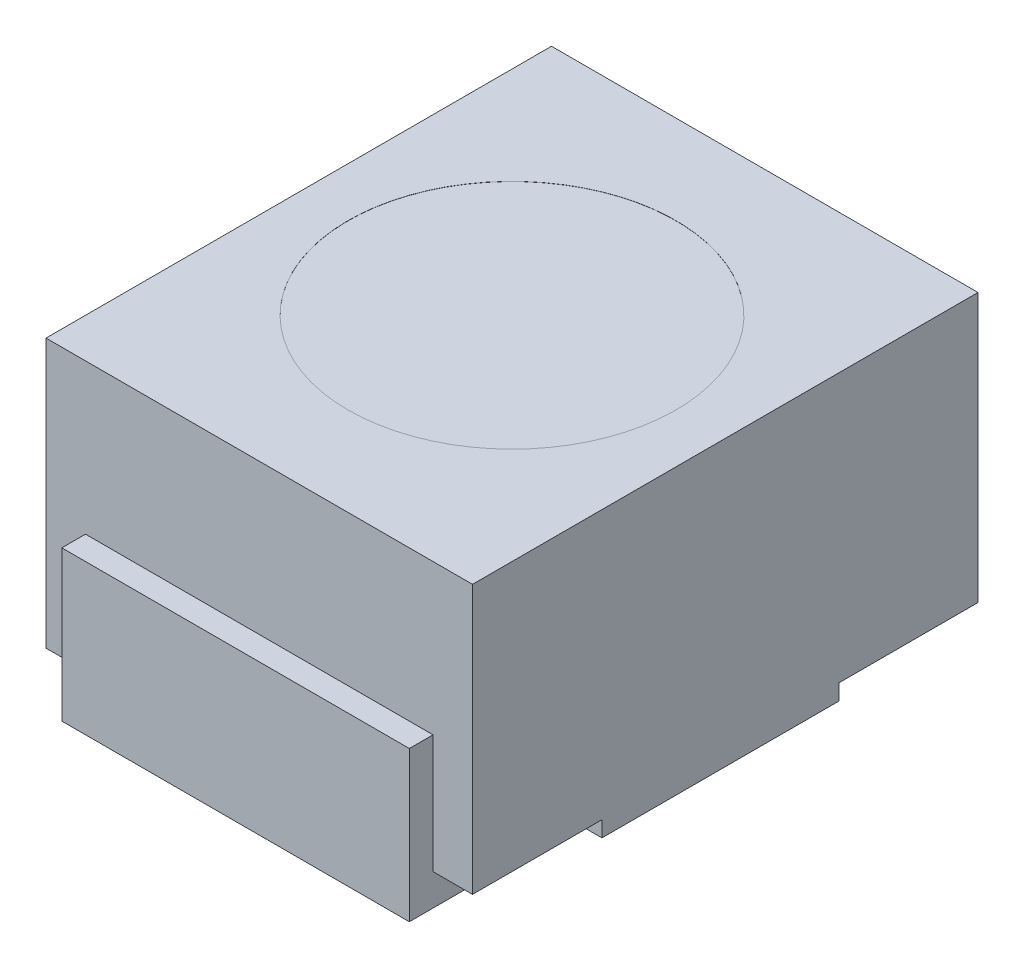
from build123d import *

# Parameters (mm, degrees)
SKETCH1_W           = 2.7
SKETCH1_H           = 3.2
BOSS_EXTRUDE1_DEPTH = 1.9
SKETCH4_W           = 2.2
SKETCH4_H           = 0.15
BOSS_EXTRUDE3_DEPTH = 0.95
SKETCH5_W           = 2.7
SKETCH5_H           = 2.828374
CUT_EXTRUDE1_DEPTH  = 0.2
SKETCH6_W           = 2.7
SKETCH6_H           = 1.5
BOSS_EXTRUDE4_DEPTH = 0.1
SKETCH7_W           = 0.332449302
SKETCH7_H           = 0.293104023
SKETCH7_W_2         = 0.537900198
SKETCH7_H_2         = 0.361587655
SKETCH7_W_3         = 0.25
SKETCH7_H_3         = 0.390122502
SKETCH7_W_4         = 0.463709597
CUT_EXTRUDE3_DEPTH  = 3.788368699
SKETCH8_W           = 2.2
SKETCH8_H           = 0.455429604
SKETCH8_H_2         = 0.575274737
BOSS_EXTRUDE5_DEPTH = 0.2
SKETCH9_R           = 1.038229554
CUT_EXTRUDE4_DEPTH  = 0.001


with BuildPart() as part:
    # Sketch1 → Boss-Extrude1 (new body)
    with BuildSketch(Plane(origin=(0, 0, 0), x_dir=(1, 0, 0), z_dir=(0, 1, 0))):
        Rectangle(SKETCH1_W, SKETCH1_H)
    extrude(amount=BOSS_EXTRUDE1_DEPTH)

    # Sketch4 → Boss-Extrude3 (add)
    with BuildSketch(Plane.XZ):
        with Locations((0, 1.675)):
            Rectangle(SKETCH4_W, SKETCH4_H)
        with Locations((0, -1.675)):
            Rectangle(SKETCH4_W, SKETCH4_H)
    extrude(amount=-BOSS_EXTRUDE3_DEPTH)

    # Sketch5 → Cut-Extrude1 (cut)
    with BuildSketch(Plane.XZ):
        with Locations((0, -0.017120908)):
            Rectangle(SKETCH5_W, SKETCH5_H)
    extrude(amount=-CUT_EXTRUDE1_DEPTH, mode=Mode.SUBTRACT)

    # Sketch6 → Boss-Extrude4 (add)
    with BuildSketch(Plane.XZ.offset(-0.2)):
        with Locations((0, 0.030713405)):
            Rectangle(SKETCH6_W, SKETCH6_H)
    extrude(amount=BOSS_EXTRUDE4_DEPTH)

    # Sketch7 → Cut-Extrude3 (cut, through all)
    with BuildSketch(Plane.XZ.offset(-0.2)):
        with Locations((-1.266224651, 1.453447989)):
            Rectangle(SKETCH7_W, SKETCH7_H)
        with Locations((1.368950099, 1.419206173)):
            Rectangle(SKETCH7_W_2, SKETCH7_H_2)
        with Locations((-1.225, -1.404938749)):
            Rectangle(SKETCH7_W_3, SKETCH7_H_3)
        with Locations((1.331854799, -1.404938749)):
            Rectangle(SKETCH7_W_4, SKETCH7_H_3)
    extrude(amount=CUT_EXTRUDE3_DEPTH, mode=Mode.SUBTRACT)

    # Sketch8 → Boss-Extrude5 (add)
    with BuildSketch(Plane.XZ.offset(-0.2)):
        with Locations((0, 1.16935129)):
            Rectangle(SKETCH8_W, SKETCH8_H)
        with Locations((0, -1.14367054)):
            Rectangle(SKETCH8_W, SKETCH8_H_2)
    extrude(amount=BOSS_EXTRUDE5_DEPTH)

    # Sketch9 → Cut-Extrude4 (cut)
    with BuildSketch(Plane(origin=(0, 1.9, 0), x_dir=(1, 0, 0), z_dir=(0, 1, 0))):
        with Locations(Location((0, 0, 0), (0, 0, 270))):
            Circle(SKETCH9_R)
    extrude(amount=-CUT_EXTRUDE4_DEPTH, mode=Mode.SUBTRACT)


solid = part.part
